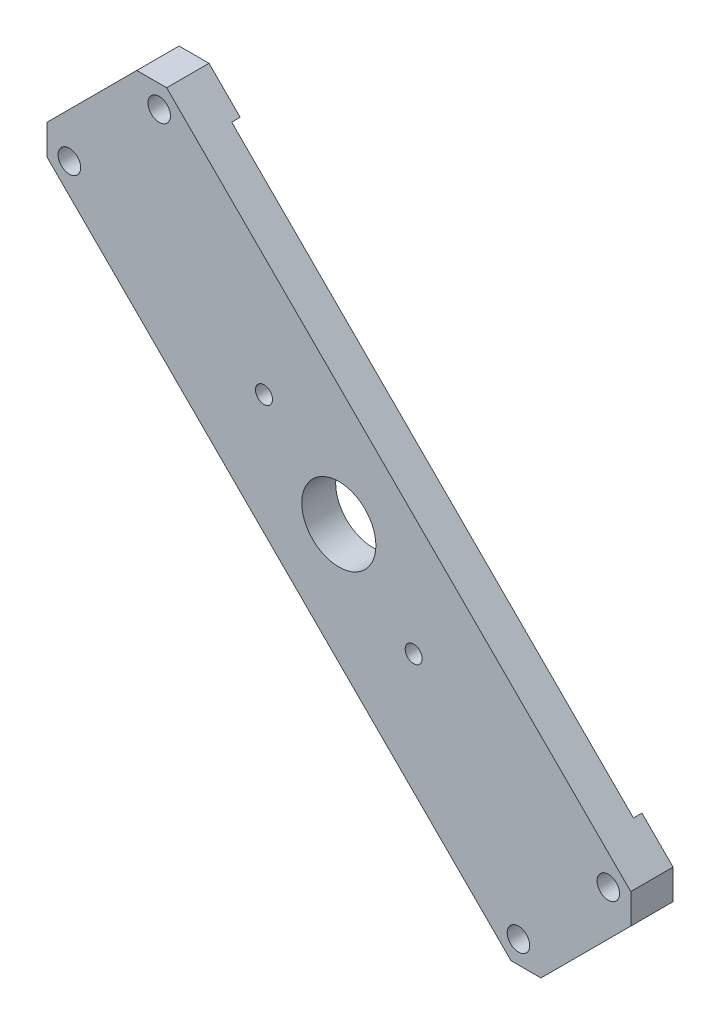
from build123d import *

# Parameters (mm, degrees)
SKETCH1_R                     = 3.3782
SKETCH1_R_2                   = 11.1125
BLOCK_DEPTH                   = 12.7
SKETCH2_R                     = 88.9
BOTTOM_RELIEF_DEPTH           = 2.54
CORNERS_SIZE                  = 6.35
SKETCH3_R                     = 4.064
SPRING_CBORES_DEPTH           = 0.762
F_1_4_20_TAPPED_FLUSH_VALVE_D = 5.1054


with BuildPart() as part:
    # Sketch1 → block (new body)
    with BuildSketch(Plane.XY):
        Polygon((-157.218600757, -9.552374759), (-9.044374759, -157.726600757), (-44.965399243, -193.647625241), (-193.139625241, -45.473399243), align=None)
        with Locations((-181.91430509, -47.718463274)):
            Circle(SKETCH1_R, mode=Mode.SUBTRACT)
        with Locations((-154.973536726, -20.77769491)):
            Circle(SKETCH1_R, mode=Mode.SUBTRACT)
        with Locations((-47.210463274, -182.42230509)):
            Circle(SKETCH1_R, mode=Mode.SUBTRACT)
        with Locations((-20.26969491, -155.481536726)):
            Circle(SKETCH1_R, mode=Mode.SUBTRACT)
        with Locations((-101.092, -101.6)):
            Circle(SKETCH1_R_2, mode=Mode.SUBTRACT)
    extrude(amount=BLOCK_DEPTH)

    # Sketch2 → bottom relief (cut)
    with BuildSketch(Plane(origin=(0, 0, 0), x_dir=(-1, 0, 0), z_dir=(0, 0, -1))):
        with Locations((101.092, -101.6)):
            Circle(SKETCH2_R)
    extrude(amount=-BOTTOM_RELIEF_DEPTH, mode=Mode.SUBTRACT)

    # corners
    corners_edges = [part.edges().sort_by_distance(p)[0] for p in [
        (-157.218600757, -9.552374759, 6.35),
        (-9.044374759, -157.726600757, 6.35),
        (-44.965399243, -193.647625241, 6.35),
        (-193.139625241, -45.473399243, 6.35),
    ]]
    chamfer(corners_edges, length=CORNERS_SIZE)

    # Sketch3 → spring cbores (cut)
    with BuildSketch(Plane(origin=(0, 0, 2.54), x_dir=(-1, 0, 0), z_dir=(0, 0, -1))):
        with Locations((134.767960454, -45.473399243)):
            Circle(SKETCH3_R)
        with Locations((157.218600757, -67.924039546)):
            Circle(SKETCH3_R)
        with Locations((44.965399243, -135.275960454)):
            Circle(SKETCH3_R)
        with Locations((67.416039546, -157.726600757)):
            Circle(SKETCH3_R)
    extrude(amount=-SPRING_CBORES_DEPTH, mode=Mode.SUBTRACT)

    # 1_4-20 Tapped flush valve (through all)
    with Locations(Plane.XY.offset(12.7)):
        with Locations((-78.641359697, -124.050640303), (-123.542640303, -79.149359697)):
            Hole(F_1_4_20_TAPPED_FLUSH_VALVE_D / 2)


solid = part.part
